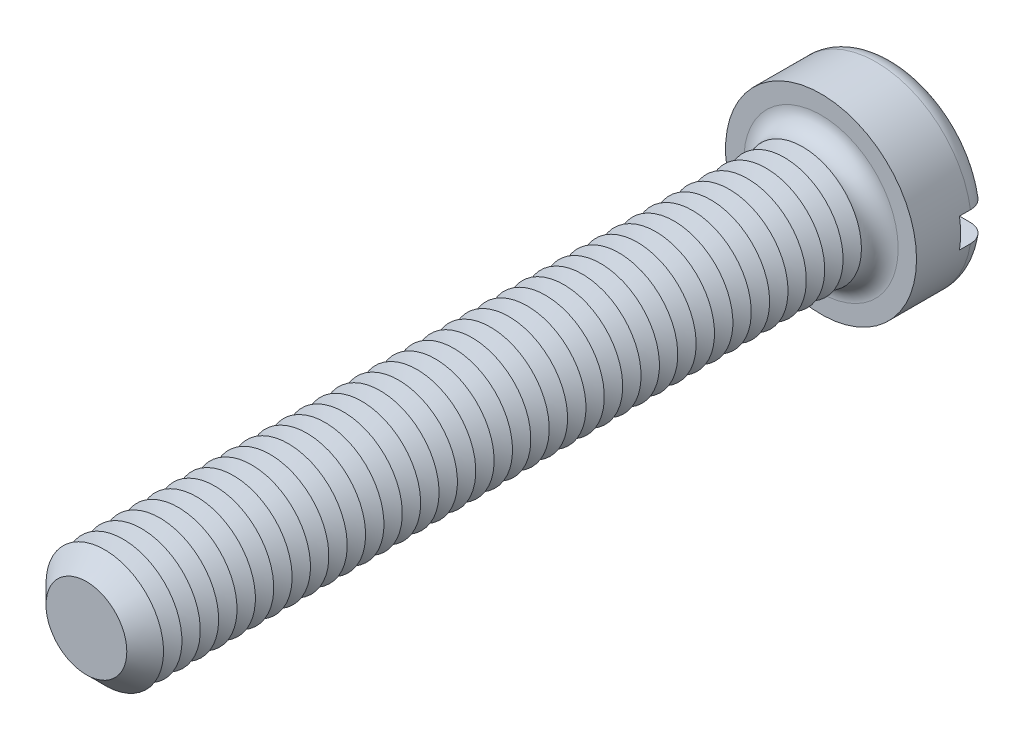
from build123d import *

# Parameters (mm, degrees)
SKETCH3_R           = 6.5
BOSS_EXTRUDE2_DEPTH = 5
SKETCH4_R           = 4
BOSS_EXTRUDE3_DEPTH = 50
FILLET1_R           = 1.25
CHAMFER1_SIZE       = 1.25
LPATTERN1_COUNT     = 38
LPATTERN1_PITCH     = 1.25
SKETCH8_W           = 13
SKETCH8_H           = 2
CUT_EXTRUDE1_DEPTH  = 2


with BuildPart() as part:
    # Sketch3 → Boss-Extrude2 (new body)
    with BuildSketch(Plane.XY):
        Circle(SKETCH3_R)
    extrude(amount=-BOSS_EXTRUDE2_DEPTH)

    # Sketch4 → Boss-Extrude3 (add)
    with BuildSketch(Plane.XY):
        Circle(SKETCH4_R)
    extrude(amount=BOSS_EXTRUDE3_DEPTH)

    # Fillet1
    fillet1_edges = [part.edges().sort_by_distance(p)[0] for p in [
        (-6.5, 0, -5),
        (-4, 0, 0),
    ]]
    fillet(fillet1_edges, radius=FILLET1_R)

    # Chamfer1
    chamfer1_edges = [part.edges().sort_by_distance(p)[0] for p in [
        (-4, 0, 50),
    ]]
    chamfer(chamfer1_edges, length=CHAMFER1_SIZE)

    # Sketch6 → Cut-Revolve1 (revolve, cut)
    with BuildSketch(Plane(origin=(0, 0, 0), x_dir=(0, 0, -1), z_dir=(1, 0, 0)), mode=Mode.PRIVATE) as cut_revolve1_sk:
        Polygon((-1.25, 4), (-1.875, 2.917468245), (-2.5, 4), align=None)
    cut_revolve1 = revolve(cut_revolve1_sk.sketch.rotate(Axis((0, 0, -1.694361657), (0, 0, 1)), 90), axis=Axis((0, 0, -1.694361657), (0, 0, 1)), mode=Mode.SUBTRACT)

    # LPattern1: Cut-Revolve1 ×38
    with Locations(*[(0, 0, i * LPATTERN1_PITCH) for i in range(1, LPATTERN1_COUNT)]):
        add(cut_revolve1, mode=Mode.SUBTRACT)

    # Sketch8 → Cut-Extrude1 (cut)
    with BuildSketch(Plane(origin=(0, 0, -5), x_dir=(-1, 0, 0), z_dir=(0, 0, -1))):
        Rectangle(SKETCH8_W, SKETCH8_H)
    extrude(amount=-CUT_EXTRUDE1_DEPTH, mode=Mode.SUBTRACT)


solid = part.part
